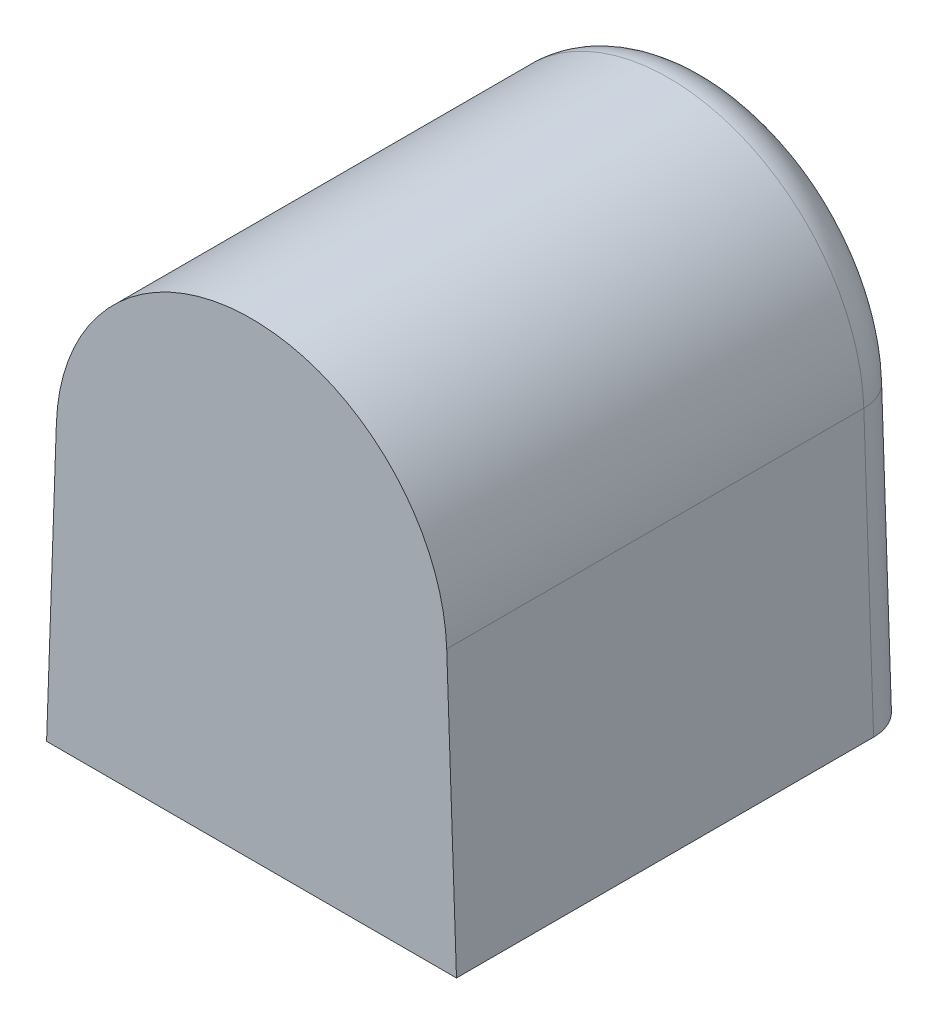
ISO-10303-21;
HEADER;
FILE_DESCRIPTION(('STEP AP214'),'2;1');
FILE_NAME('part.step','',(''),(''),'','','');
FILE_SCHEMA(('AUTOMOTIVE_DESIGN { 1 0 10303 214 1 1 1 1 }'));
ENDSEC;
DATA;
#1=APPLICATION_CONTEXT('core data for automotive mechanical design processes');
#2=APPLICATION_PROTOCOL_DEFINITION('international standard','automotive_design',2000,#1);
#3=PRODUCT_CONTEXT('',#1,'mechanical');
#4=PRODUCT('Part','Part','',(#3));
#5=PRODUCT_RELATED_PRODUCT_CATEGORY('part','',(#4));
#6=PRODUCT_DEFINITION_FORMATION('','',#4);
#7=PRODUCT_DEFINITION_CONTEXT('part definition',#1,'design');
#8=PRODUCT_DEFINITION('design','',#6,#7);
#9=PRODUCT_DEFINITION_SHAPE('','',#8);
#10=(LENGTH_UNIT() NAMED_UNIT(*) SI_UNIT(.MILLI.,.METRE.));
#11=(NAMED_UNIT(*) PLANE_ANGLE_UNIT() SI_UNIT($,.RADIAN.));
#12=(NAMED_UNIT(*) SI_UNIT($,.STERADIAN.) SOLID_ANGLE_UNIT());
#13=UNCERTAINTY_MEASURE_WITH_UNIT(LENGTH_MEASURE(1.E-05),#10,'distance_accuracy_value','');
#14=(GEOMETRIC_REPRESENTATION_CONTEXT(3) GLOBAL_UNCERTAINTY_ASSIGNED_CONTEXT((#13)) GLOBAL_UNIT_ASSIGNED_CONTEXT((#10,
#11,#12)) REPRESENTATION_CONTEXT('',''));
#15=CARTESIAN_POINT('',(0.,0.,0.));
#16=DIRECTION('',(0.,0.,1.));
#17=DIRECTION('',(1.,0.,0.));
#18=AXIS2_PLACEMENT_3D('',#15,#16,#17);
#19=CARTESIAN_POINT('',(14.25,0.,-32.));
#20=DIRECTION('',(0.999390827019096,0.0348994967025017,0.));
#21=DIRECTION('',(-0.0348994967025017,0.999390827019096,0.));
#22=AXIS2_PLACEMENT_3D('',#19,#20,#21);
#23=PLANE('',#22);
#24=DIRECTION('',(0.,0.,1.));
#25=VECTOR('',#24,1.);
#26=CARTESIAN_POINT('',(14.25,0.,-32.));
#27=LINE('',#26,#25);
#28=CARTESIAN_POINT('',(14.25,0.,-29.));
#29=VERTEX_POINT('',#28);
#30=CARTESIAN_POINT('',(14.25,0.,0.));
#31=VERTEX_POINT('',#30);
#32=EDGE_CURVE('E114',#29,#31,#27,.T.);
#33=ORIENTED_EDGE('',*,*,#32,.F.);
#34=DIRECTION('',(-0.0348994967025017,0.999390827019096,0.));
#35=VECTOR('',#34,1.);
#36=CARTESIAN_POINT('',(14.25,0.,-29.));
#37=LINE('',#36,#35);
#38=CARTESIAN_POINT('',(13.569957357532,19.4738733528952,-29.));
#39=VERTEX_POINT('',#38);
#40=EDGE_CURVE('E92',#29,#39,#37,.T.);
#41=ORIENTED_EDGE('',*,*,#40,.T.);
#42=DIRECTION('',(0.,0.,1.));
#43=VECTOR('',#42,1.);
#44=CARTESIAN_POINT('',(13.569957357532,19.4738733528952,-32.));
#45=LINE('',#44,#43);
#46=CARTESIAN_POINT('',(13.569957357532,19.4738733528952,0.));
#47=VERTEX_POINT('',#46);
#48=EDGE_CURVE('E85',#39,#47,#45,.T.);
#49=ORIENTED_EDGE('',*,*,#48,.T.);
#50=DIRECTION('',(-0.0348994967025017,0.999390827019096,0.));
#51=VECTOR('',#50,1.);
#52=CARTESIAN_POINT('',(14.25,0.,0.));
#53=LINE('',#52,#51);
#54=EDGE_CURVE('E89',#31,#47,#53,.T.);
#55=ORIENTED_EDGE('',*,*,#54,.F.);
#56=EDGE_LOOP('',(#33,#41,#49,#55));
#57=FACE_BOUND('',#56,.T.);
#58=ADVANCED_FACE('F32',(#57),#23,.T.);
#59=CARTESIAN_POINT('',(-14.25,0.,-32.));
#60=DIRECTION('',(0.,-1.,0.));
#61=DIRECTION('',(0.,0.,-1.));
#62=AXIS2_PLACEMENT_3D('',#59,#60,#61);
#63=PLANE('',#62);
#64=DIRECTION('',(1.,0.,0.));
#65=VECTOR('',#64,1.);
#66=CARTESIAN_POINT('',(-14.25,0.,-32.));
#67=LINE('',#66,#65);
#68=CARTESIAN_POINT('',(-11.2481713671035,0.,-32.));
#69=VERTEX_POINT('',#68);
#70=CARTESIAN_POINT('',(11.2481713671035,0.,-32.));
#71=VERTEX_POINT('',#70);
#72=EDGE_CURVE('E94',#69,#71,#67,.T.);
#73=ORIENTED_EDGE('',*,*,#72,.T.);
#74=CARTESIAN_POINT('',(11.2481713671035,0.,-29.));
#75=DIRECTION('',(0.,-1.,0.));
#76=DIRECTION('',(-1.,0.,0.));
#77=AXIS2_PLACEMENT_3D('',#74,#75,#76);
#78=ELLIPSE('',#77,3.00182863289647,3.);
#79=EDGE_CURVE('E128',#71,#29,#78,.T.);
#80=ORIENTED_EDGE('',*,*,#79,.T.);
#81=ORIENTED_EDGE('',*,*,#32,.T.);
#82=DIRECTION('',(1.,0.,0.));
#83=VECTOR('',#82,1.);
#84=CARTESIAN_POINT('',(-14.25,0.,0.));
#85=LINE('',#84,#83);
#86=CARTESIAN_POINT('',(-14.25,0.,0.));
#87=VERTEX_POINT('',#86);
#88=EDGE_CURVE('E106',#87,#31,#85,.T.);
#89=ORIENTED_EDGE('',*,*,#88,.F.);
#90=DIRECTION('',(0.,0.,1.));
#91=VECTOR('',#90,1.);
#92=CARTESIAN_POINT('',(-14.25,0.,-32.));
#93=LINE('',#92,#91);
#94=CARTESIAN_POINT('',(-14.25,0.,-29.));
#95=VERTEX_POINT('',#94);
#96=EDGE_CURVE('E116',#95,#87,#93,.T.);
#97=ORIENTED_EDGE('',*,*,#96,.F.);
#98=CARTESIAN_POINT('',(-11.2481713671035,0.,-29.));
#99=DIRECTION('',(0.,-1.,0.));
#100=DIRECTION('',(-1.,0.,0.));
#101=AXIS2_PLACEMENT_3D('',#98,#99,#100);
#102=ELLIPSE('',#101,3.00182863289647,3.);
#103=EDGE_CURVE('E126',#95,#69,#102,.T.);
#104=ORIENTED_EDGE('',*,*,#103,.T.);
#105=EDGE_LOOP('',(#73,#80,#81,#89,#97,#104));
#106=FACE_BOUND('',#105,.T.);
#107=ADVANCED_FACE('F145',(#106),#63,.T.);
#108=CARTESIAN_POINT('',(-14.25,0.,-32.));
#109=DIRECTION('',(-0.999390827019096,0.0348994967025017,0.));
#110=DIRECTION('',(-0.0348994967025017,-0.999390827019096,0.));
#111=AXIS2_PLACEMENT_3D('',#108,#109,#110);
#112=PLANE('',#111);
#113=DIRECTION('',(0.,0.,1.));
#114=VECTOR('',#113,1.);
#115=CARTESIAN_POINT('',(-13.569957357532,19.4738733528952,-32.));
#116=LINE('',#115,#114);
#117=CARTESIAN_POINT('',(-13.569957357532,19.4738733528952,-29.));
#118=VERTEX_POINT('',#117);
#119=CARTESIAN_POINT('',(-13.569957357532,19.4738733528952,0.));
#120=VERTEX_POINT('',#119);
#121=EDGE_CURVE('E93',#118,#120,#116,.T.);
#122=ORIENTED_EDGE('',*,*,#121,.F.);
#123=DIRECTION('',(-0.0348994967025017,-0.999390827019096,0.));
#124=VECTOR('',#123,1.);
#125=CARTESIAN_POINT('',(-14.25,0.,-29.));
#126=LINE('',#125,#124);
#127=EDGE_CURVE('E41',#118,#95,#126,.T.);
#128=ORIENTED_EDGE('',*,*,#127,.T.);
#129=ORIENTED_EDGE('',*,*,#96,.T.);
#130=DIRECTION('',(-0.0348994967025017,-0.999390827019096,0.));
#131=VECTOR('',#130,1.);
#132=CARTESIAN_POINT('',(-14.25,0.,0.));
#133=LINE('',#132,#131);
#134=EDGE_CURVE('E102',#120,#87,#133,.T.);
#135=ORIENTED_EDGE('',*,*,#134,.F.);
#136=EDGE_LOOP('',(#122,#128,#129,#135));
#137=FACE_BOUND('',#136,.T.);
#138=ADVANCED_FACE('F155',(#137),#112,.T.);
#139=CARTESIAN_POINT('',(0.,19.,-32.));
#140=DIRECTION('',(0.,0.,1.));
#141=DIRECTION('',(1.,0.,0.));
#142=AXIS2_PLACEMENT_3D('',#139,#140,#141);
#143=CYLINDRICAL_SURFACE('',#142,13.5782288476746);
#144=ORIENTED_EDGE('',*,*,#48,.F.);
#145=CARTESIAN_POINT('',(0.,19.,-29.));
#146=DIRECTION('',(0.,0.,-1.));
#147=DIRECTION('',(-1.,0.,0.));
#148=AXIS2_PLACEMENT_3D('',#145,#146,#147);
#149=CIRCLE('',#148,13.5782288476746);
#150=EDGE_CURVE('E11',#39,#118,#149,.F.);
#151=ORIENTED_EDGE('',*,*,#150,.T.);
#152=ORIENTED_EDGE('',*,*,#121,.T.);
#153=CARTESIAN_POINT('',(0.,19.,0.));
#154=DIRECTION('',(0.,0.,1.));
#155=DIRECTION('',(-1.,0.,0.));
#156=AXIS2_PLACEMENT_3D('',#153,#154,#155);
#157=CIRCLE('',#156,13.5782288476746);
#158=EDGE_CURVE('E97',#47,#120,#157,.T.);
#159=ORIENTED_EDGE('',*,*,#158,.F.);
#160=EDGE_LOOP('',(#144,#151,#152,#159));
#161=FACE_BOUND('',#160,.T.);
#162=ADVANCED_FACE('F98',(#161),#143,.T.);
#163=CARTESIAN_POINT('',(0.,19.,-32.));
#164=DIRECTION('',(0.,0.,-1.));
#165=DIRECTION('',(-1.,0.,0.));
#166=AXIS2_PLACEMENT_3D('',#163,#164,#165);
#167=PLANE('',#166);
#168=CARTESIAN_POINT('',(0.,19.,-32.));
#169=DIRECTION('',(0.,0.,-1.));
#170=DIRECTION('',(-1.,0.,0.));
#171=AXIS2_PLACEMENT_3D('',#168,#169,#170);
#172=CIRCLE('',#171,10.5782288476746);
#173=CARTESIAN_POINT('',(-10.5717848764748,19.3691748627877,-32.));
#174=VERTEX_POINT('',#173);
#175=CARTESIAN_POINT('',(10.5717848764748,19.3691748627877,-32.));
#176=VERTEX_POINT('',#175);
#177=EDGE_CURVE('E120',#174,#176,#172,.T.);
#178=ORIENTED_EDGE('',*,*,#177,.T.);
#179=DIRECTION('',(-0.0348994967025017,0.999390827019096,0.));
#180=VECTOR('',#179,1.);
#181=CARTESIAN_POINT('',(10.5717848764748,19.3691748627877,-32.));
#182=LINE('',#181,#180);
#183=EDGE_CURVE('E124',#176,#71,#182,.F.);
#184=ORIENTED_EDGE('',*,*,#183,.T.);
#185=ORIENTED_EDGE('',*,*,#72,.F.);
#186=DIRECTION('',(-0.0348994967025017,-0.999390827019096,0.));
#187=VECTOR('',#186,1.);
#188=CARTESIAN_POINT('',(-10.5717848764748,19.3691748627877,-32.));
#189=LINE('',#188,#187);
#190=EDGE_CURVE('E122',#69,#174,#189,.F.);
#191=ORIENTED_EDGE('',*,*,#190,.T.);
#192=EDGE_LOOP('',(#178,#184,#185,#191));
#193=FACE_BOUND('',#192,.T.);
#194=ADVANCED_FACE('F147',(#193),#167,.T.);
#195=CARTESIAN_POINT('',(0.,19.,0.));
#196=DIRECTION('',(0.,0.,-1.));
#197=DIRECTION('',(-1.,0.,0.));
#198=AXIS2_PLACEMENT_3D('',#195,#196,#197);
#199=PLANE('',#198);
#200=ORIENTED_EDGE('',*,*,#54,.T.);
#201=ORIENTED_EDGE('',*,*,#158,.T.);
#202=ORIENTED_EDGE('',*,*,#134,.T.);
#203=ORIENTED_EDGE('',*,*,#88,.T.);
#204=EDGE_LOOP('',(#200,#201,#202,#203));
#205=FACE_BOUND('',#204,.T.);
#206=ADVANCED_FACE('F104',(#205),#199,.F.);
#207=CARTESIAN_POINT('',(-11.2518275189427,-0.104698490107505,-29.));
#208=DIRECTION('',(-0.0348994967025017,-0.999390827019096,0.));
#209=DIRECTION('',(0.999390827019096,-0.0348994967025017,0.));
#210=AXIS2_PLACEMENT_3D('',#207,#208,#209);
#211=CYLINDRICAL_SURFACE('',#210,3.);
#212=ORIENTED_EDGE('',*,*,#103,.F.);
#213=ORIENTED_EDGE('',*,*,#127,.F.);
#214=CARTESIAN_POINT('',(-10.5717848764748,19.3691748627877,-29.));
#215=DIRECTION('',(0.0348994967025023,0.999390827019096,0.));
#216=DIRECTION('',(-0.999390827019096,0.0348994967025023,0.));
#217=AXIS2_PLACEMENT_3D('',#214,#215,#216);
#218=CIRCLE('',#217,3.);
#219=EDGE_CURVE('E36',#174,#118,#218,.T.);
#220=ORIENTED_EDGE('',*,*,#219,.F.);
#221=ORIENTED_EDGE('',*,*,#190,.F.);
#222=EDGE_LOOP('',(#212,#213,#220,#221));
#223=FACE_BOUND('',#222,.T.);
#224=ADVANCED_FACE('F34',(#223),#211,.T.);
#225=CARTESIAN_POINT('',(0.,19.,-29.));
#226=DIRECTION('',(0.,0.,-1.));
#227=DIRECTION('',(-1.,0.,0.));
#228=AXIS2_PLACEMENT_3D('',#225,#226,#227);
#229=TOROIDAL_SURFACE('',#228,10.5782288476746,3.);
#230=ORIENTED_EDGE('',*,*,#219,.T.);
#231=ORIENTED_EDGE('',*,*,#150,.F.);
#232=CARTESIAN_POINT('',(10.5717848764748,19.3691748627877,-29.));
#233=DIRECTION('',(0.0348994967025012,-0.999390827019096,0.));
#234=DIRECTION('',(0.999390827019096,0.0348994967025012,0.));
#235=AXIS2_PLACEMENT_3D('',#232,#233,#234);
#236=CIRCLE('',#235,3.);
#237=EDGE_CURVE('E109',#176,#39,#236,.T.);
#238=ORIENTED_EDGE('',*,*,#237,.F.);
#239=ORIENTED_EDGE('',*,*,#177,.F.);
#240=EDGE_LOOP('',(#230,#231,#238,#239));
#241=FACE_BOUND('',#240,.T.);
#242=ADVANCED_FACE('F137',(#241),#229,.T.);
#243=CARTESIAN_POINT('',(11.2518275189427,-0.104698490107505,-29.));
#244=DIRECTION('',(-0.0348994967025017,0.999390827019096,0.));
#245=DIRECTION('',(-0.999390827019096,-0.0348994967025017,0.));
#246=AXIS2_PLACEMENT_3D('',#243,#244,#245);
#247=CYLINDRICAL_SURFACE('',#246,3.);
#248=ORIENTED_EDGE('',*,*,#79,.F.);
#249=ORIENTED_EDGE('',*,*,#183,.F.);
#250=ORIENTED_EDGE('',*,*,#237,.T.);
#251=ORIENTED_EDGE('',*,*,#40,.F.);
#252=EDGE_LOOP('',(#248,#249,#250,#251));
#253=FACE_BOUND('',#252,.T.);
#254=ADVANCED_FACE('F134',(#253),#247,.T.);
#255=CLOSED_SHELL('',(#58,#107,#138,#162,#194,#206,#224,#242,#254));
#256=MANIFOLD_SOLID_BREP('B2',#255);
#257=ADVANCED_BREP_SHAPE_REPRESENTATION('',(#18,#256),#14);
#258=SHAPE_DEFINITION_REPRESENTATION(#9,#257);
ENDSEC;
END-ISO-10303-21;
